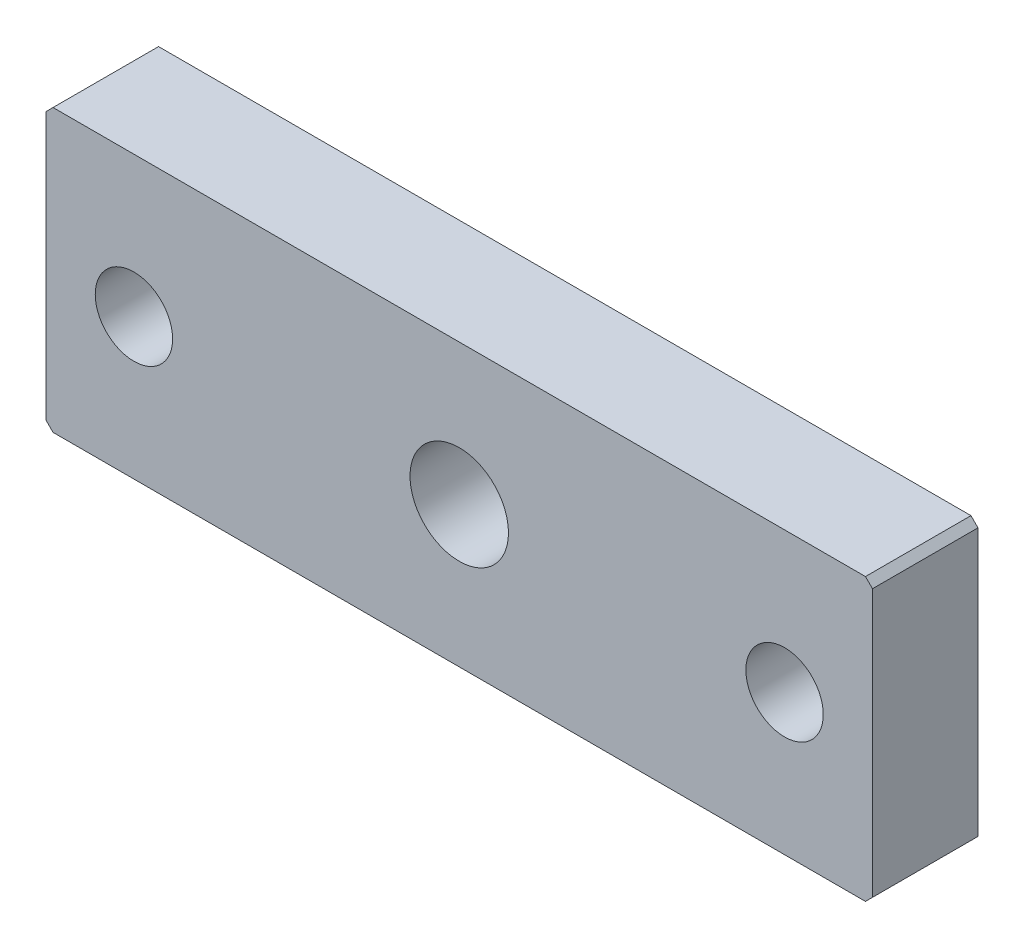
ISO-10303-21;
HEADER;
FILE_DESCRIPTION(('STEP AP214'),'2;1');
FILE_NAME('part.step','',(''),(''),'','','');
FILE_SCHEMA(('AUTOMOTIVE_DESIGN { 1 0 10303 214 1 1 1 1 }'));
ENDSEC;
DATA;
#1=APPLICATION_CONTEXT('core data for automotive mechanical design processes');
#2=APPLICATION_PROTOCOL_DEFINITION('international standard','automotive_design',2000,#1);
#3=PRODUCT_CONTEXT('',#1,'mechanical');
#4=PRODUCT('Part','Part','',(#3));
#5=PRODUCT_RELATED_PRODUCT_CATEGORY('part','',(#4));
#6=PRODUCT_DEFINITION_FORMATION('','',#4);
#7=PRODUCT_DEFINITION_CONTEXT('part definition',#1,'design');
#8=PRODUCT_DEFINITION('design','',#6,#7);
#9=PRODUCT_DEFINITION_SHAPE('','',#8);
#10=(LENGTH_UNIT() NAMED_UNIT(*) SI_UNIT(.MILLI.,.METRE.));
#11=(NAMED_UNIT(*) PLANE_ANGLE_UNIT() SI_UNIT($,.RADIAN.));
#12=(NAMED_UNIT(*) SI_UNIT($,.STERADIAN.) SOLID_ANGLE_UNIT());
#13=UNCERTAINTY_MEASURE_WITH_UNIT(LENGTH_MEASURE(1.E-05),#10,'distance_accuracy_value','');
#14=(GEOMETRIC_REPRESENTATION_CONTEXT(3) GLOBAL_UNCERTAINTY_ASSIGNED_CONTEXT((#13)) GLOBAL_UNIT_ASSIGNED_CONTEXT((#10,
#11,#12)) REPRESENTATION_CONTEXT('',''));
#15=CARTESIAN_POINT('',(0.,0.,0.));
#16=DIRECTION('',(0.,0.,1.));
#17=DIRECTION('',(1.,0.,0.));
#18=AXIS2_PLACEMENT_3D('',#15,#16,#17);
#19=CARTESIAN_POINT('',(-117.5,40.,0.));
#20=DIRECTION('',(0.,0.,1.));
#21=DIRECTION('',(1.,0.,0.));
#22=AXIS2_PLACEMENT_3D('',#19,#20,#21);
#23=PLANE('',#22);
#24=CARTESIAN_POINT('',(-92.5,0.,0.));
#25=DIRECTION('',(0.,0.,-1.));
#26=DIRECTION('',(-1.,0.,0.));
#27=AXIS2_PLACEMENT_3D('',#24,#25,#26);
#28=CIRCLE('',#27,11.);
#29=CARTESIAN_POINT('',(-103.5,0.,0.));
#30=VERTEX_POINT('',#29);
#31=EDGE_CURVE('E105',#30,#30,#28,.T.);
#32=ORIENTED_EDGE('',*,*,#31,.F.);
#33=EDGE_LOOP('',(#32));
#34=FACE_BOUND('',#33,.T.);
#35=CARTESIAN_POINT('',(0.,0.,0.));
#36=DIRECTION('',(0.,0.,1.));
#37=DIRECTION('',(1.,0.,0.));
#38=AXIS2_PLACEMENT_3D('',#35,#36,#37);
#39=CIRCLE('',#38,14.);
#40=CARTESIAN_POINT('',(14.,0.,0.));
#41=VERTEX_POINT('',#40);
#42=EDGE_CURVE('E115',#41,#41,#39,.T.);
#43=ORIENTED_EDGE('',*,*,#42,.T.);
#44=EDGE_LOOP('',(#43));
#45=FACE_BOUND('',#44,.T.);
#46=DIRECTION('',(1.,0.,0.));
#47=VECTOR('',#46,1.);
#48=CARTESIAN_POINT('',(-117.5,-40.,0.));
#49=LINE('',#48,#47);
#50=CARTESIAN_POINT('',(-115.5,-40.,0.));
#51=VERTEX_POINT('',#50);
#52=CARTESIAN_POINT('',(115.5,-40.,0.));
#53=VERTEX_POINT('',#52);
#54=EDGE_CURVE('E135',#51,#53,#49,.T.);
#55=ORIENTED_EDGE('',*,*,#54,.F.);
#56=DIRECTION('',(0.70710678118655,-0.707106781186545,0.));
#57=VECTOR('',#56,1.);
#58=CARTESIAN_POINT('',(-115.5,-40.,0.));
#59=LINE('',#58,#57);
#60=CARTESIAN_POINT('',(-117.5,-38.,0.));
#61=VERTEX_POINT('',#60);
#62=EDGE_CURVE('E152',#51,#61,#59,.F.);
#63=ORIENTED_EDGE('',*,*,#62,.T.);
#64=DIRECTION('',(0.,-1.,0.));
#65=VECTOR('',#64,1.);
#66=CARTESIAN_POINT('',(-117.5,40.,0.));
#67=LINE('',#66,#65);
#68=CARTESIAN_POINT('',(-117.5,38.,0.));
#69=VERTEX_POINT('',#68);
#70=EDGE_CURVE('E118',#69,#61,#67,.T.);
#71=ORIENTED_EDGE('',*,*,#70,.F.);
#72=DIRECTION('',(-0.70710678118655,-0.707106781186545,0.));
#73=VECTOR('',#72,1.);
#74=CARTESIAN_POINT('',(-117.5,38.,0.));
#75=LINE('',#74,#73);
#76=CARTESIAN_POINT('',(-115.5,40.,0.));
#77=VERTEX_POINT('',#76);
#78=EDGE_CURVE('E150',#69,#77,#75,.F.);
#79=ORIENTED_EDGE('',*,*,#78,.T.);
#80=DIRECTION('',(-1.,0.,0.));
#81=VECTOR('',#80,1.);
#82=CARTESIAN_POINT('',(-117.5,40.,0.));
#83=LINE('',#82,#81);
#84=CARTESIAN_POINT('',(115.5,40.,0.));
#85=VERTEX_POINT('',#84);
#86=EDGE_CURVE('E125',#85,#77,#83,.T.);
#87=ORIENTED_EDGE('',*,*,#86,.F.);
#88=DIRECTION('',(-0.707106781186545,0.70710678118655,0.));
#89=VECTOR('',#88,1.);
#90=CARTESIAN_POINT('',(115.5,40.,0.));
#91=LINE('',#90,#89);
#92=CARTESIAN_POINT('',(117.5,38.,0.));
#93=VERTEX_POINT('',#92);
#94=EDGE_CURVE('E148',#85,#93,#91,.F.);
#95=ORIENTED_EDGE('',*,*,#94,.T.);
#96=DIRECTION('',(0.,1.,0.));
#97=VECTOR('',#96,1.);
#98=CARTESIAN_POINT('',(117.5,40.,0.));
#99=LINE('',#98,#97);
#100=CARTESIAN_POINT('',(117.5,-38.,0.));
#101=VERTEX_POINT('',#100);
#102=EDGE_CURVE('E138',#101,#93,#99,.T.);
#103=ORIENTED_EDGE('',*,*,#102,.F.);
#104=DIRECTION('',(0.707106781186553,0.707106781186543,0.));
#105=VECTOR('',#104,1.);
#106=CARTESIAN_POINT('',(117.5,-38.,0.));
#107=LINE('',#106,#105);
#108=EDGE_CURVE('E146',#101,#53,#107,.F.);
#109=ORIENTED_EDGE('',*,*,#108,.T.);
#110=EDGE_LOOP('',(#55,#63,#71,#79,#87,#95,#103,#109));
#111=FACE_BOUND('',#110,.T.);
#112=CARTESIAN_POINT('',(92.5,0.,0.));
#113=DIRECTION('',(0.,0.,-1.));
#114=DIRECTION('',(-1.,0.,0.));
#115=AXIS2_PLACEMENT_3D('',#112,#113,#114);
#116=CIRCLE('',#115,11.);
#117=CARTESIAN_POINT('',(81.5,0.,0.));
#118=VERTEX_POINT('',#117);
#119=EDGE_CURVE('E328',#118,#118,#116,.T.);
#120=ORIENTED_EDGE('',*,*,#119,.F.);
#121=EDGE_LOOP('',(#120));
#122=FACE_BOUND('',#121,.T.);
#123=ADVANCED_FACE('F16',(#34,#45,#111,#122),#23,.F.);
#124=CARTESIAN_POINT('',(-117.5,-40.,30.));
#125=DIRECTION('',(0.,1.,0.));
#126=DIRECTION('',(0.,0.,1.));
#127=AXIS2_PLACEMENT_3D('',#124,#125,#126);
#128=PLANE('',#127);
#129=DIRECTION('',(1.,0.,0.));
#130=VECTOR('',#129,1.);
#131=CARTESIAN_POINT('',(-117.5,-40.,30.));
#132=LINE('',#131,#130);
#133=CARTESIAN_POINT('',(-115.5,-40.,30.));
#134=VERTEX_POINT('',#133);
#135=CARTESIAN_POINT('',(115.5,-40.,30.));
#136=VERTEX_POINT('',#135);
#137=EDGE_CURVE('E124',#134,#136,#132,.T.);
#138=ORIENTED_EDGE('',*,*,#137,.F.);
#139=DIRECTION('',(0.,0.,-1.));
#140=VECTOR('',#139,1.);
#141=CARTESIAN_POINT('',(-115.5,-40.,30.));
#142=LINE('',#141,#140);
#143=EDGE_CURVE('E143',#134,#51,#142,.T.);
#144=ORIENTED_EDGE('',*,*,#143,.T.);
#145=ORIENTED_EDGE('',*,*,#54,.T.);
#146=DIRECTION('',(0.,0.,1.));
#147=VECTOR('',#146,1.);
#148=CARTESIAN_POINT('',(115.5,-40.,30.));
#149=LINE('',#148,#147);
#150=EDGE_CURVE('E132',#53,#136,#149,.T.);
#151=ORIENTED_EDGE('',*,*,#150,.T.);
#152=EDGE_LOOP('',(#138,#144,#145,#151));
#153=FACE_BOUND('',#152,.T.);
#154=CARTESIAN_POINT('',(7.5,-40.,22.5));
#155=DIRECTION('',(0.,-1.,0.));
#156=DIRECTION('',(0.,0.,-1.));
#157=AXIS2_PLACEMENT_3D('',#154,#155,#156);
#158=CIRCLE('',#157,2.1);
#159=CARTESIAN_POINT('',(7.5,-40.,20.4));
#160=VERTEX_POINT('',#159);
#161=EDGE_CURVE('E111',#160,#160,#158,.T.);
#162=ORIENTED_EDGE('',*,*,#161,.F.);
#163=EDGE_LOOP('',(#162));
#164=FACE_BOUND('',#163,.T.);
#165=CARTESIAN_POINT('',(-7.5,-40.,22.5));
#166=DIRECTION('',(0.,-1.,0.));
#167=DIRECTION('',(0.,0.,-1.));
#168=AXIS2_PLACEMENT_3D('',#165,#166,#167);
#169=CIRCLE('',#168,2.1);
#170=CARTESIAN_POINT('',(-7.5,-40.,20.4));
#171=VERTEX_POINT('',#170);
#172=EDGE_CURVE('E98',#171,#171,#169,.T.);
#173=ORIENTED_EDGE('',*,*,#172,.F.);
#174=EDGE_LOOP('',(#173));
#175=FACE_BOUND('',#174,.T.);
#176=ADVANCED_FACE('F202',(#153,#164,#175),#128,.F.);
#177=CARTESIAN_POINT('',(-117.5,40.,30.));
#178=DIRECTION('',(1.,0.,0.));
#179=DIRECTION('',(0.,1.,0.));
#180=AXIS2_PLACEMENT_3D('',#177,#178,#179);
#181=PLANE('',#180);
#182=ORIENTED_EDGE('',*,*,#70,.T.);
#183=DIRECTION('',(0.,0.,1.));
#184=VECTOR('',#183,1.);
#185=CARTESIAN_POINT('',(-117.5,-38.,30.));
#186=LINE('',#185,#184);
#187=CARTESIAN_POINT('',(-117.5,-38.,30.));
#188=VERTEX_POINT('',#187);
#189=EDGE_CURVE('E157',#61,#188,#186,.T.);
#190=ORIENTED_EDGE('',*,*,#189,.T.);
#191=DIRECTION('',(0.,-1.,0.));
#192=VECTOR('',#191,1.);
#193=CARTESIAN_POINT('',(-117.5,40.,30.));
#194=LINE('',#193,#192);
#195=CARTESIAN_POINT('',(-117.5,38.,30.));
#196=VERTEX_POINT('',#195);
#197=EDGE_CURVE('E121',#196,#188,#194,.T.);
#198=ORIENTED_EDGE('',*,*,#197,.F.);
#199=DIRECTION('',(0.,0.,-1.));
#200=VECTOR('',#199,1.);
#201=CARTESIAN_POINT('',(-117.5,38.,30.));
#202=LINE('',#201,#200);
#203=EDGE_CURVE('E154',#196,#69,#202,.T.);
#204=ORIENTED_EDGE('',*,*,#203,.T.);
#205=EDGE_LOOP('',(#182,#190,#198,#204));
#206=FACE_BOUND('',#205,.T.);
#207=ADVANCED_FACE('F195',(#206),#181,.F.);
#208=CARTESIAN_POINT('',(117.5,40.,30.));
#209=DIRECTION('',(-1.,0.,0.));
#210=DIRECTION('',(0.,0.,1.));
#211=AXIS2_PLACEMENT_3D('',#208,#209,#210);
#212=PLANE('',#211);
#213=ORIENTED_EDGE('',*,*,#102,.T.);
#214=DIRECTION('',(0.,0.,1.));
#215=VECTOR('',#214,1.);
#216=CARTESIAN_POINT('',(117.5,38.,30.));
#217=LINE('',#216,#215);
#218=CARTESIAN_POINT('',(117.5,38.,30.));
#219=VERTEX_POINT('',#218);
#220=EDGE_CURVE('E11',#93,#219,#217,.T.);
#221=ORIENTED_EDGE('',*,*,#220,.T.);
#222=DIRECTION('',(0.,1.,0.));
#223=VECTOR('',#222,1.);
#224=CARTESIAN_POINT('',(117.5,40.,30.));
#225=LINE('',#224,#223);
#226=CARTESIAN_POINT('',(117.5,-38.,30.));
#227=VERTEX_POINT('',#226);
#228=EDGE_CURVE('E128',#227,#219,#225,.T.);
#229=ORIENTED_EDGE('',*,*,#228,.F.);
#230=DIRECTION('',(0.,0.,-1.));
#231=VECTOR('',#230,1.);
#232=CARTESIAN_POINT('',(117.5,-38.,30.));
#233=LINE('',#232,#231);
#234=EDGE_CURVE('E25',#227,#101,#233,.T.);
#235=ORIENTED_EDGE('',*,*,#234,.T.);
#236=EDGE_LOOP('',(#213,#221,#229,#235));
#237=FACE_BOUND('',#236,.T.);
#238=ADVANCED_FACE('F175',(#237),#212,.F.);
#239=CARTESIAN_POINT('',(-117.5,40.,30.));
#240=DIRECTION('',(0.,-1.,0.));
#241=DIRECTION('',(0.,0.,-1.));
#242=AXIS2_PLACEMENT_3D('',#239,#240,#241);
#243=PLANE('',#242);
#244=ORIENTED_EDGE('',*,*,#86,.T.);
#245=DIRECTION('',(0.,0.,1.));
#246=VECTOR('',#245,1.);
#247=CARTESIAN_POINT('',(-115.5,40.,30.));
#248=LINE('',#247,#246);
#249=CARTESIAN_POINT('',(-115.5,40.,30.));
#250=VERTEX_POINT('',#249);
#251=EDGE_CURVE('E33',#77,#250,#248,.T.);
#252=ORIENTED_EDGE('',*,*,#251,.T.);
#253=DIRECTION('',(-1.,0.,0.));
#254=VECTOR('',#253,1.);
#255=CARTESIAN_POINT('',(-117.5,40.,30.));
#256=LINE('',#255,#254);
#257=CARTESIAN_POINT('',(115.5,40.,30.));
#258=VERTEX_POINT('',#257);
#259=EDGE_CURVE('E130',#258,#250,#256,.T.);
#260=ORIENTED_EDGE('',*,*,#259,.F.);
#261=DIRECTION('',(0.,0.,-1.));
#262=VECTOR('',#261,1.);
#263=CARTESIAN_POINT('',(115.5,40.,30.));
#264=LINE('',#263,#262);
#265=EDGE_CURVE('E166',#258,#85,#264,.T.);
#266=ORIENTED_EDGE('',*,*,#265,.T.);
#267=EDGE_LOOP('',(#244,#252,#260,#266));
#268=FACE_BOUND('',#267,.T.);
#269=ADVANCED_FACE('F186',(#268),#243,.F.);
#270=CARTESIAN_POINT('',(-117.5,40.,30.));
#271=DIRECTION('',(0.,0.,1.));
#272=DIRECTION('',(1.,0.,0.));
#273=AXIS2_PLACEMENT_3D('',#270,#271,#272);
#274=PLANE('',#273);
#275=CARTESIAN_POINT('',(92.5,0.,30.));
#276=DIRECTION('',(0.,0.,1.));
#277=DIRECTION('',(1.,0.,0.));
#278=AXIS2_PLACEMENT_3D('',#275,#276,#277);
#279=CIRCLE('',#278,11.);
#280=CARTESIAN_POINT('',(103.5,0.,30.));
#281=VERTEX_POINT('',#280);
#282=EDGE_CURVE('E20',#281,#281,#279,.T.);
#283=ORIENTED_EDGE('',*,*,#282,.F.);
#284=EDGE_LOOP('',(#283));
#285=FACE_BOUND('',#284,.T.);
#286=CARTESIAN_POINT('',(-92.5,0.,30.));
#287=DIRECTION('',(0.,0.,1.));
#288=DIRECTION('',(1.,0.,0.));
#289=AXIS2_PLACEMENT_3D('',#286,#287,#288);
#290=CIRCLE('',#289,11.);
#291=CARTESIAN_POINT('',(-81.5,0.,30.));
#292=VERTEX_POINT('',#291);
#293=EDGE_CURVE('E99',#292,#292,#290,.T.);
#294=ORIENTED_EDGE('',*,*,#293,.F.);
#295=EDGE_LOOP('',(#294));
#296=FACE_BOUND('',#295,.T.);
#297=CARTESIAN_POINT('',(0.,0.,30.));
#298=DIRECTION('',(0.,0.,1.));
#299=DIRECTION('',(1.,0.,0.));
#300=AXIS2_PLACEMENT_3D('',#297,#298,#299);
#301=CIRCLE('',#300,14.);
#302=CARTESIAN_POINT('',(14.,0.,30.));
#303=VERTEX_POINT('',#302);
#304=EDGE_CURVE('E114',#303,#303,#301,.T.);
#305=ORIENTED_EDGE('',*,*,#304,.F.);
#306=EDGE_LOOP('',(#305));
#307=FACE_BOUND('',#306,.T.);
#308=ORIENTED_EDGE('',*,*,#197,.T.);
#309=DIRECTION('',(-0.70710678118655,0.707106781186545,0.));
#310=VECTOR('',#309,1.);
#311=CARTESIAN_POINT('',(-156.5,0.999999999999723,30.));
#312=LINE('',#311,#310);
#313=EDGE_CURVE('E164',#188,#134,#312,.F.);
#314=ORIENTED_EDGE('',*,*,#313,.T.);
#315=ORIENTED_EDGE('',*,*,#137,.T.);
#316=DIRECTION('',(-0.707106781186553,-0.707106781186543,0.));
#317=VECTOR('',#316,1.);
#318=CARTESIAN_POINT('',(38.9999999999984,-116.5,30.));
#319=LINE('',#318,#317);
#320=EDGE_CURVE('E159',#136,#227,#319,.F.);
#321=ORIENTED_EDGE('',*,*,#320,.T.);
#322=ORIENTED_EDGE('',*,*,#228,.T.);
#323=DIRECTION('',(0.707106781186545,-0.70710678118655,0.));
#324=VECTOR('',#323,1.);
#325=CARTESIAN_POINT('',(-0.999999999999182,156.5,30.));
#326=LINE('',#325,#324);
#327=EDGE_CURVE('E40',#219,#258,#326,.F.);
#328=ORIENTED_EDGE('',*,*,#327,.T.);
#329=ORIENTED_EDGE('',*,*,#259,.T.);
#330=DIRECTION('',(0.70710678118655,0.707106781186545,0.));
#331=VECTOR('',#330,1.);
#332=CARTESIAN_POINT('',(-116.5,39.,30.));
#333=LINE('',#332,#331);
#334=EDGE_CURVE('E162',#250,#196,#333,.F.);
#335=ORIENTED_EDGE('',*,*,#334,.T.);
#336=EDGE_LOOP('',(#308,#314,#315,#321,#322,#328,#329,#335));
#337=FACE_BOUND('',#336,.T.);
#338=ADVANCED_FACE('F188',(#285,#296,#307,#337),#274,.T.);
#339=CARTESIAN_POINT('',(0.,0.,0.));
#340=DIRECTION('',(0.,0.,1.));
#341=DIRECTION('',(1.,0.,0.));
#342=AXIS2_PLACEMENT_3D('',#339,#340,#341);
#343=CYLINDRICAL_SURFACE('',#342,14.);
#344=ORIENTED_EDGE('',*,*,#42,.F.);
#345=EDGE_LOOP('',(#344));
#346=FACE_BOUND('',#345,.T.);
#347=ORIENTED_EDGE('',*,*,#304,.T.);
#348=EDGE_LOOP('',(#347));
#349=FACE_BOUND('',#348,.T.);
#350=ADVANCED_FACE('F280',(#346,#349),#343,.F.);
#351=CARTESIAN_POINT('',(7.5,-40.,22.5));
#352=DIRECTION('',(0.,-1.,0.));
#353=DIRECTION('',(0.,0.,-1.));
#354=AXIS2_PLACEMENT_3D('',#351,#352,#353);
#355=CYLINDRICAL_SURFACE('',#354,2.1);
#356=CARTESIAN_POINT('',(7.5,-23.,22.5));
#357=DIRECTION('',(0.,-1.,0.));
#358=DIRECTION('',(0.,0.,-1.));
#359=AXIS2_PLACEMENT_3D('',#356,#357,#358);
#360=CIRCLE('',#359,2.1);
#361=CARTESIAN_POINT('',(7.5,-23.,20.4));
#362=VERTEX_POINT('',#361);
#363=EDGE_CURVE('E102',#362,#362,#360,.T.);
#364=ORIENTED_EDGE('',*,*,#363,.F.);
#365=EDGE_LOOP('',(#364));
#366=FACE_BOUND('',#365,.T.);
#367=ORIENTED_EDGE('',*,*,#161,.T.);
#368=EDGE_LOOP('',(#367));
#369=FACE_BOUND('',#368,.T.);
#370=ADVANCED_FACE('F287',(#366,#369),#355,.F.);
#371=CARTESIAN_POINT('',(7.5,-23.,22.5));
#372=DIRECTION('',(0.,-1.,0.));
#373=DIRECTION('',(0.,0.,-1.));
#374=AXIS2_PLACEMENT_3D('',#371,#372,#373);
#375=CONICAL_SURFACE('',#374,2.1,1.0471975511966);
#376=CARTESIAN_POINT('',(7.5,-21.7875644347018,22.5));
#377=VERTEX_POINT('',#376);
#378=VERTEX_LOOP('',#377);
#379=FACE_BOUND('',#378,.T.);
#380=ORIENTED_EDGE('',*,*,#363,.T.);
#381=EDGE_LOOP('',(#380));
#382=FACE_BOUND('',#381,.T.);
#383=ADVANCED_FACE('F294',(#379,#382),#375,.F.);
#384=CARTESIAN_POINT('',(-7.5,-40.,22.5));
#385=DIRECTION('',(0.,-1.,0.));
#386=DIRECTION('',(0.,0.,-1.));
#387=AXIS2_PLACEMENT_3D('',#384,#385,#386);
#388=CYLINDRICAL_SURFACE('',#387,2.1);
#389=CARTESIAN_POINT('',(-7.5,-23.,22.5));
#390=DIRECTION('',(0.,-1.,0.));
#391=DIRECTION('',(0.,0.,-1.));
#392=AXIS2_PLACEMENT_3D('',#389,#390,#391);
#393=CIRCLE('',#392,2.1);
#394=CARTESIAN_POINT('',(-7.5,-23.,20.4));
#395=VERTEX_POINT('',#394);
#396=EDGE_CURVE('E96',#395,#395,#393,.T.);
#397=ORIENTED_EDGE('',*,*,#396,.F.);
#398=EDGE_LOOP('',(#397));
#399=FACE_BOUND('',#398,.T.);
#400=ORIENTED_EDGE('',*,*,#172,.T.);
#401=EDGE_LOOP('',(#400));
#402=FACE_BOUND('',#401,.T.);
#403=ADVANCED_FACE('F92',(#399,#402),#388,.F.);
#404=CARTESIAN_POINT('',(-7.5,-23.,22.5));
#405=DIRECTION('',(0.,-1.,0.));
#406=DIRECTION('',(0.,0.,-1.));
#407=AXIS2_PLACEMENT_3D('',#404,#405,#406);
#408=CONICAL_SURFACE('',#407,2.1,1.0471975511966);
#409=CARTESIAN_POINT('',(-7.5,-21.7875644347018,22.5));
#410=VERTEX_POINT('',#409);
#411=VERTEX_LOOP('',#410);
#412=FACE_BOUND('',#411,.T.);
#413=ORIENTED_EDGE('',*,*,#396,.T.);
#414=EDGE_LOOP('',(#413));
#415=FACE_BOUND('',#414,.T.);
#416=ADVANCED_FACE('F88',(#412,#415),#408,.F.);
#417=CARTESIAN_POINT('',(-115.5,-40.,30.));
#418=DIRECTION('',(0.707106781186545,0.70710678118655,0.));
#419=DIRECTION('',(-0.70710678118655,0.707106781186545,0.));
#420=AXIS2_PLACEMENT_3D('',#417,#418,#419);
#421=PLANE('',#420);
#422=ORIENTED_EDGE('',*,*,#313,.F.);
#423=ORIENTED_EDGE('',*,*,#189,.F.);
#424=ORIENTED_EDGE('',*,*,#62,.F.);
#425=ORIENTED_EDGE('',*,*,#143,.F.);
#426=EDGE_LOOP('',(#422,#423,#424,#425));
#427=FACE_BOUND('',#426,.T.);
#428=ADVANCED_FACE('F91',(#427),#421,.F.);
#429=CARTESIAN_POINT('',(-117.5,38.,30.));
#430=DIRECTION('',(0.707106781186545,-0.70710678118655,0.));
#431=DIRECTION('',(0.70710678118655,0.707106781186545,0.));
#432=AXIS2_PLACEMENT_3D('',#429,#430,#431);
#433=PLANE('',#432);
#434=ORIENTED_EDGE('',*,*,#334,.F.);
#435=ORIENTED_EDGE('',*,*,#251,.F.);
#436=ORIENTED_EDGE('',*,*,#78,.F.);
#437=ORIENTED_EDGE('',*,*,#203,.F.);
#438=EDGE_LOOP('',(#434,#435,#436,#437));
#439=FACE_BOUND('',#438,.T.);
#440=ADVANCED_FACE('F192',(#439),#433,.F.);
#441=CARTESIAN_POINT('',(115.5,40.,30.));
#442=DIRECTION('',(-0.70710678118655,-0.707106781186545,0.));
#443=DIRECTION('',(0.707106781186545,-0.70710678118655,0.));
#444=AXIS2_PLACEMENT_3D('',#441,#442,#443);
#445=PLANE('',#444);
#446=ORIENTED_EDGE('',*,*,#327,.F.);
#447=ORIENTED_EDGE('',*,*,#220,.F.);
#448=ORIENTED_EDGE('',*,*,#94,.F.);
#449=ORIENTED_EDGE('',*,*,#265,.F.);
#450=EDGE_LOOP('',(#446,#447,#448,#449));
#451=FACE_BOUND('',#450,.T.);
#452=ADVANCED_FACE('F185',(#451),#445,.F.);
#453=CARTESIAN_POINT('',(117.5,-38.,30.));
#454=DIRECTION('',(-0.707106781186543,0.707106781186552,0.));
#455=DIRECTION('',(-0.707106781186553,-0.707106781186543,0.));
#456=AXIS2_PLACEMENT_3D('',#453,#454,#455);
#457=PLANE('',#456);
#458=ORIENTED_EDGE('',*,*,#320,.F.);
#459=ORIENTED_EDGE('',*,*,#150,.F.);
#460=ORIENTED_EDGE('',*,*,#108,.F.);
#461=ORIENTED_EDGE('',*,*,#234,.F.);
#462=EDGE_LOOP('',(#458,#459,#460,#461));
#463=FACE_BOUND('',#462,.T.);
#464=ADVANCED_FACE('F18',(#463),#457,.F.);
#465=CARTESIAN_POINT('',(-92.5,0.,0.));
#466=DIRECTION('',(0.,0.,-1.));
#467=DIRECTION('',(-1.,0.,0.));
#468=AXIS2_PLACEMENT_3D('',#465,#466,#467);
#469=CYLINDRICAL_SURFACE('',#468,11.);
#470=ORIENTED_EDGE('',*,*,#293,.T.);
#471=EDGE_LOOP('',(#470));
#472=FACE_BOUND('',#471,.T.);
#473=ORIENTED_EDGE('',*,*,#31,.T.);
#474=EDGE_LOOP('',(#473));
#475=FACE_BOUND('',#474,.T.);
#476=ADVANCED_FACE('F206',(#472,#475),#469,.F.);
#477=CARTESIAN_POINT('',(92.5,0.,0.));
#478=DIRECTION('',(0.,0.,-1.));
#479=DIRECTION('',(-1.,0.,0.));
#480=AXIS2_PLACEMENT_3D('',#477,#478,#479);
#481=CYLINDRICAL_SURFACE('',#480,11.);
#482=ORIENTED_EDGE('',*,*,#282,.T.);
#483=EDGE_LOOP('',(#482));
#484=FACE_BOUND('',#483,.T.);
#485=ORIENTED_EDGE('',*,*,#119,.T.);
#486=EDGE_LOOP('',(#485));
#487=FACE_BOUND('',#486,.T.);
#488=ADVANCED_FACE('F213',(#484,#487),#481,.F.);
#489=CLOSED_SHELL('',(#123,#176,#207,#238,#269,#338,#350,#370,#383,#403,#416,#428,#440,#452,
#464,#476,#488));
#490=MANIFOLD_SOLID_BREP('B1',#489);
#491=ADVANCED_BREP_SHAPE_REPRESENTATION('',(#18,#490),#14);
#492=SHAPE_DEFINITION_REPRESENTATION(#9,#491);
ENDSEC;
END-ISO-10303-21;
